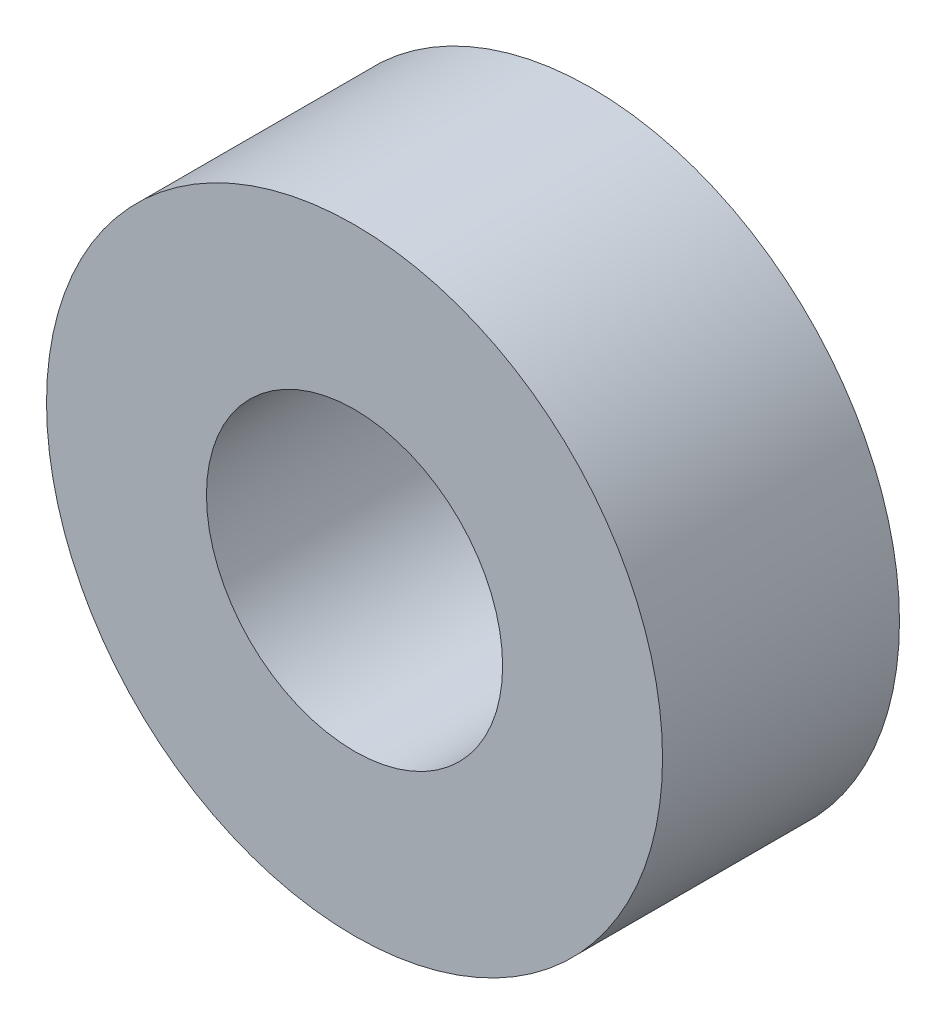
ISO-10303-21;
HEADER;
FILE_DESCRIPTION(('STEP AP214'),'2;1');
FILE_NAME('part.step','',(''),(''),'','','');
FILE_SCHEMA(('AUTOMOTIVE_DESIGN { 1 0 10303 214 1 1 1 1 }'));
ENDSEC;
DATA;
#1=APPLICATION_CONTEXT('core data for automotive mechanical design processes');
#2=APPLICATION_PROTOCOL_DEFINITION('international standard','automotive_design',2000,#1);
#3=PRODUCT_CONTEXT('',#1,'mechanical');
#4=PRODUCT('Part','Part','',(#3));
#5=PRODUCT_RELATED_PRODUCT_CATEGORY('part','',(#4));
#6=PRODUCT_DEFINITION_FORMATION('','',#4);
#7=PRODUCT_DEFINITION_CONTEXT('part definition',#1,'design');
#8=PRODUCT_DEFINITION('design','',#6,#7);
#9=PRODUCT_DEFINITION_SHAPE('','',#8);
#10=(LENGTH_UNIT() NAMED_UNIT(*) SI_UNIT(.MILLI.,.METRE.));
#11=(NAMED_UNIT(*) PLANE_ANGLE_UNIT() SI_UNIT($,.RADIAN.));
#12=(NAMED_UNIT(*) SI_UNIT($,.STERADIAN.) SOLID_ANGLE_UNIT());
#13=UNCERTAINTY_MEASURE_WITH_UNIT(LENGTH_MEASURE(1.E-05),#10,'distance_accuracy_value','');
#14=(GEOMETRIC_REPRESENTATION_CONTEXT(3) GLOBAL_UNCERTAINTY_ASSIGNED_CONTEXT((#13)) GLOBAL_UNIT_ASSIGNED_CONTEXT((#10,
#11,#12)) REPRESENTATION_CONTEXT('',''));
#15=CARTESIAN_POINT('',(0.,0.,0.));
#16=DIRECTION('',(0.,0.,1.));
#17=DIRECTION('',(1.,0.,0.));
#18=AXIS2_PLACEMENT_3D('',#15,#16,#17);
#19=CARTESIAN_POINT('',(0.,0.,20.));
#20=DIRECTION('',(0.,0.,1.));
#21=DIRECTION('',(1.,0.,0.));
#22=AXIS2_PLACEMENT_3D('',#19,#20,#21);
#23=PLANE('',#22);
#24=CARTESIAN_POINT('',(0.,0.,20.));
#25=DIRECTION('',(0.,0.,1.));
#26=DIRECTION('',(1.,0.,0.));
#27=AXIS2_PLACEMENT_3D('',#24,#25,#26);
#28=CIRCLE('',#27,26.);
#29=CARTESIAN_POINT('',(26.,0.,20.));
#30=VERTEX_POINT('',#29);
#31=EDGE_CURVE('E10',#30,#30,#28,.T.);
#32=ORIENTED_EDGE('',*,*,#31,.T.);
#33=EDGE_LOOP('',(#32));
#34=FACE_BOUND('',#33,.T.);
#35=CARTESIAN_POINT('',(0.,0.,20.));
#36=DIRECTION('',(0.,0.,1.));
#37=DIRECTION('',(1.,0.,0.));
#38=AXIS2_PLACEMENT_3D('',#35,#36,#37);
#39=CIRCLE('',#38,12.5);
#40=CARTESIAN_POINT('',(12.5,0.,20.));
#41=VERTEX_POINT('',#40);
#42=EDGE_CURVE('E45',#41,#41,#39,.T.);
#43=ORIENTED_EDGE('',*,*,#42,.F.);
#44=EDGE_LOOP('',(#43));
#45=FACE_BOUND('',#44,.T.);
#46=ADVANCED_FACE('F34',(#34,#45),#23,.T.);
#47=CARTESIAN_POINT('',(0.,0.,0.));
#48=DIRECTION('',(0.,0.,1.));
#49=DIRECTION('',(1.,0.,0.));
#50=AXIS2_PLACEMENT_3D('',#47,#48,#49);
#51=PLANE('',#50);
#52=CARTESIAN_POINT('',(0.,0.,0.));
#53=DIRECTION('',(0.,0.,1.));
#54=DIRECTION('',(1.,0.,0.));
#55=AXIS2_PLACEMENT_3D('',#52,#53,#54);
#56=CIRCLE('',#55,26.);
#57=CARTESIAN_POINT('',(26.,0.,0.));
#58=VERTEX_POINT('',#57);
#59=EDGE_CURVE('E38',#58,#58,#56,.T.);
#60=ORIENTED_EDGE('',*,*,#59,.F.);
#61=EDGE_LOOP('',(#60));
#62=FACE_BOUND('',#61,.T.);
#63=CARTESIAN_POINT('',(0.,0.,0.));
#64=DIRECTION('',(0.,0.,1.));
#65=DIRECTION('',(1.,0.,0.));
#66=AXIS2_PLACEMENT_3D('',#63,#64,#65);
#67=CIRCLE('',#66,12.5);
#68=CARTESIAN_POINT('',(12.5,0.,0.));
#69=VERTEX_POINT('',#68);
#70=EDGE_CURVE('E47',#69,#69,#67,.T.);
#71=ORIENTED_EDGE('',*,*,#70,.T.);
#72=EDGE_LOOP('',(#71));
#73=FACE_BOUND('',#72,.T.);
#74=ADVANCED_FACE('F57',(#62,#73),#51,.F.);
#75=CARTESIAN_POINT('',(0.,0.,20.));
#76=DIRECTION('',(0.,0.,-1.));
#77=DIRECTION('',(-1.,0.,0.));
#78=AXIS2_PLACEMENT_3D('',#75,#76,#77);
#79=CYLINDRICAL_SURFACE('',#78,26.);
#80=ORIENTED_EDGE('',*,*,#31,.F.);
#81=EDGE_LOOP('',(#80));
#82=FACE_BOUND('',#81,.T.);
#83=ORIENTED_EDGE('',*,*,#59,.T.);
#84=EDGE_LOOP('',(#83));
#85=FACE_BOUND('',#84,.T.);
#86=ADVANCED_FACE('F36',(#82,#85),#79,.T.);
#87=CARTESIAN_POINT('',(0.,0.,20.));
#88=DIRECTION('',(0.,0.,-1.));
#89=DIRECTION('',(-1.,0.,0.));
#90=AXIS2_PLACEMENT_3D('',#87,#88,#89);
#91=CYLINDRICAL_SURFACE('',#90,12.5);
#92=ORIENTED_EDGE('',*,*,#42,.T.);
#93=EDGE_LOOP('',(#92));
#94=FACE_BOUND('',#93,.T.);
#95=ORIENTED_EDGE('',*,*,#70,.F.);
#96=EDGE_LOOP('',(#95));
#97=FACE_BOUND('',#96,.T.);
#98=ADVANCED_FACE('F53',(#94,#97),#91,.F.);
#99=CLOSED_SHELL('',(#46,#74,#86,#98));
#100=MANIFOLD_SOLID_BREP('B2',#99);
#101=ADVANCED_BREP_SHAPE_REPRESENTATION('',(#18,#100),#14);
#102=SHAPE_DEFINITION_REPRESENTATION(#9,#101);
ENDSEC;
END-ISO-10303-21;
